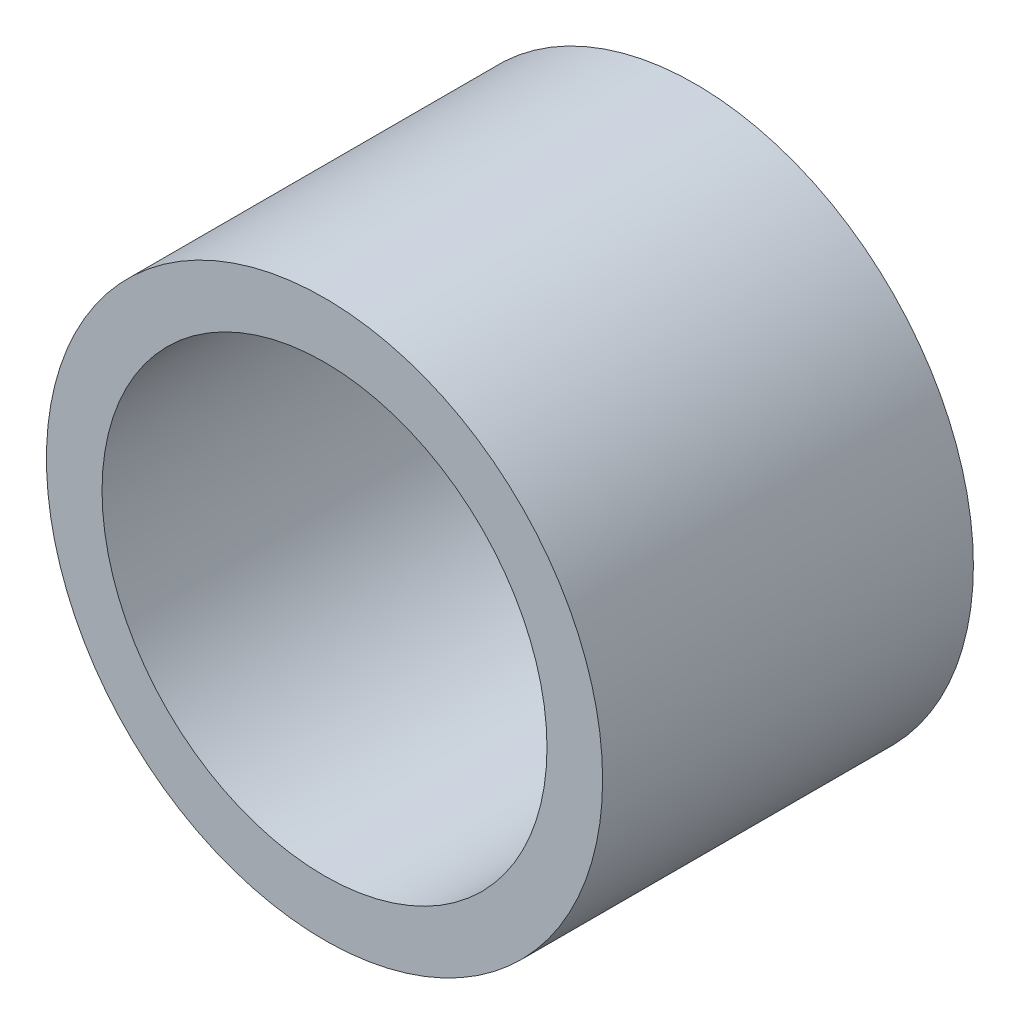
from build123d import *

# Parameters (mm, degrees)
SKETCH1_R      = 38.1
SKETCH1_R_2    = 30.48
EXTRUDE1_DEPTH = 25.4


with BuildPart() as part:
    # Sketch1 → Extrude1 (new, symmetric)
    with BuildSketch(Plane.XY):
        Circle(SKETCH1_R)
        Circle(SKETCH1_R_2, mode=Mode.SUBTRACT)
    extrude(amount=EXTRUDE1_DEPTH, both=True)


solid = part.part
